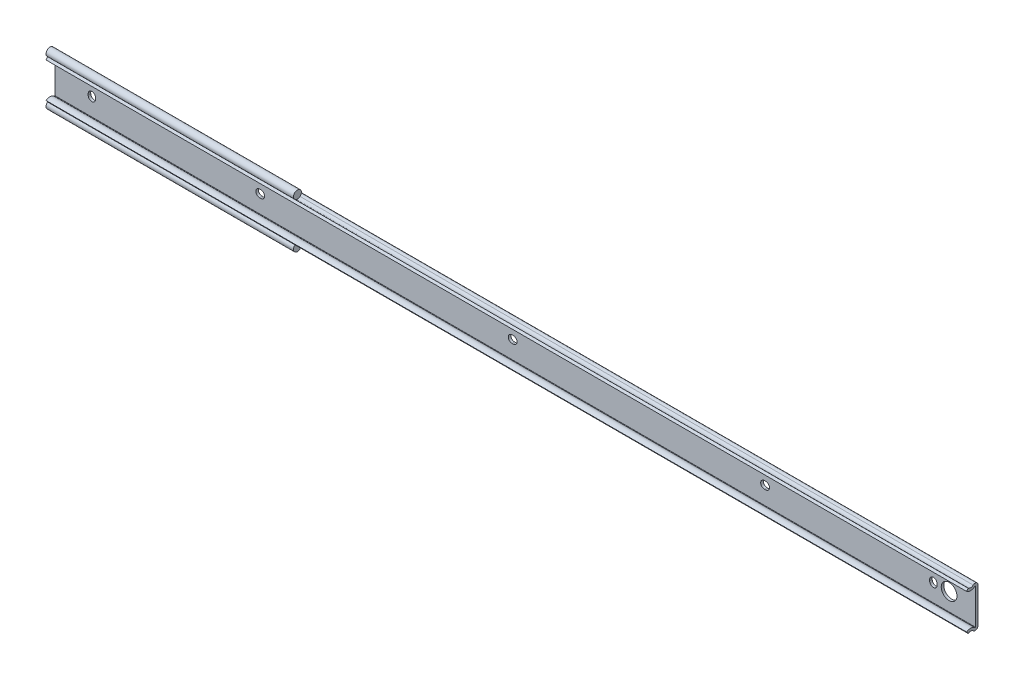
ISO-10303-21;
HEADER;
FILE_DESCRIPTION(('STEP AP214'),'2;1');
FILE_NAME('part.step','',(''),(''),'','','');
FILE_SCHEMA(('AUTOMOTIVE_DESIGN { 1 0 10303 214 1 1 1 1 }'));
ENDSEC;
DATA;
#1=APPLICATION_CONTEXT('core data for automotive mechanical design processes');
#2=APPLICATION_PROTOCOL_DEFINITION('international standard','automotive_design',2000,#1);
#3=PRODUCT_CONTEXT('',#1,'mechanical');
#4=PRODUCT('Part','Part','',(#3));
#5=PRODUCT_RELATED_PRODUCT_CATEGORY('part','',(#4));
#6=PRODUCT_DEFINITION_FORMATION('','',#4);
#7=PRODUCT_DEFINITION_CONTEXT('part definition',#1,'design');
#8=PRODUCT_DEFINITION('design','',#6,#7);
#9=PRODUCT_DEFINITION_SHAPE('','',#8);
#10=(LENGTH_UNIT() NAMED_UNIT(*) SI_UNIT(.MILLI.,.METRE.));
#11=(NAMED_UNIT(*) PLANE_ANGLE_UNIT() SI_UNIT($,.RADIAN.));
#12=(NAMED_UNIT(*) SI_UNIT($,.STERADIAN.) SOLID_ANGLE_UNIT());
#13=UNCERTAINTY_MEASURE_WITH_UNIT(LENGTH_MEASURE(1.E-05),#10,'distance_accuracy_value','');
#14=(GEOMETRIC_REPRESENTATION_CONTEXT(3) GLOBAL_UNCERTAINTY_ASSIGNED_CONTEXT((#13)) GLOBAL_UNIT_ASSIGNED_CONTEXT((#10,
#11,#12)) REPRESENTATION_CONTEXT('',''));
#15=CARTESIAN_POINT('',(0.,0.,0.));
#16=DIRECTION('',(0.,0.,1.));
#17=DIRECTION('',(1.,0.,0.));
#18=AXIS2_PLACEMENT_3D('',#15,#16,#17);
#19=CARTESIAN_POINT('',(533.4,10.6847650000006,1.74000019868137));
#20=DIRECTION('',(-1.,0.,0.));
#21=DIRECTION('',(0.,0.,1.));
#22=AXIS2_PLACEMENT_3D('',#19,#20,#21);
#23=CYLINDRICAL_SURFACE('',#22,1.7400001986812);
#24=CARTESIAN_POINT('',(-22.4,10.6847650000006,1.74000019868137));
#25=DIRECTION('',(1.,0.,0.));
#26=DIRECTION('',(0.,0.,-1.));
#27=AXIS2_PLACEMENT_3D('',#24,#25,#26);
#28=CIRCLE('',#27,1.7400001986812);
#29=CARTESIAN_POINT('',(-22.4,12.421670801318,1.84372545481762));
#30=VERTEX_POINT('',#29);
#31=CARTESIAN_POINT('',(-22.4,12.1726708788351,2.64207380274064));
#32=VERTEX_POINT('',#31);
#33=EDGE_CURVE('E275',#30,#32,#28,.T.);
#34=ORIENTED_EDGE('',*,*,#33,.T.);
#35=DIRECTION('',(-1.,0.,0.));
#36=VECTOR('',#35,1.);
#37=CARTESIAN_POINT('',(52.3,12.1726708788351,2.64207380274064));
#38=LINE('',#37,#36);
#39=CARTESIAN_POINT('',(127.,12.1726708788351,2.64207380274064));
#40=VERTEX_POINT('',#39);
#41=EDGE_CURVE('E492',#32,#40,#38,.F.);
#42=ORIENTED_EDGE('',*,*,#41,.T.);
#43=CARTESIAN_POINT('',(127.,10.6847650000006,1.74000019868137));
#44=DIRECTION('',(-1.,0.,0.));
#45=DIRECTION('',(0.,0.,1.));
#46=AXIS2_PLACEMENT_3D('',#43,#44,#45);
#47=CIRCLE('',#46,1.7400001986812);
#48=CARTESIAN_POINT('',(127.,11.9768810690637,2.90534853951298));
#49=VERTEX_POINT('',#48);
#50=EDGE_CURVE('E488',#49,#40,#47,.T.);
#51=ORIENTED_EDGE('',*,*,#50,.F.);
#52=DIRECTION('',(-1.,0.,0.));
#53=VECTOR('',#52,1.);
#54=CARTESIAN_POINT('',(533.4,11.9768810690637,2.90534853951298));
#55=LINE('',#54,#53);
#56=CARTESIAN_POINT('',(533.4,11.9768810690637,2.90534853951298));
#57=VERTEX_POINT('',#56);
#58=EDGE_CURVE('E365',#57,#49,#55,.T.);
#59=ORIENTED_EDGE('',*,*,#58,.F.);
#60=CARTESIAN_POINT('',(533.4,10.6847650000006,1.74000019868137));
#61=DIRECTION('',(1.,0.,0.));
#62=DIRECTION('',(0.,0.,-1.));
#63=AXIS2_PLACEMENT_3D('',#60,#61,#62);
#64=CIRCLE('',#63,1.7400001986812);
#65=CARTESIAN_POINT('',(533.4,12.421670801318,1.84372545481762));
#66=VERTEX_POINT('',#65);
#67=EDGE_CURVE('E272',#66,#57,#64,.T.);
#68=ORIENTED_EDGE('',*,*,#67,.F.);
#69=CARTESIAN_POINT('',(533.4,10.6847650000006,1.74000019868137));
#70=DIRECTION('',(-1.,0.,0.));
#71=DIRECTION('',(0.,0.998221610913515,0.0596122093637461));
#72=AXIS2_PLACEMENT_3D('',#69,#70,#71);
#73=CIRCLE('',#72,1.7400001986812);
#74=CARTESIAN_POINT('',(533.4,12.421670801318,1.63627494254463));
#75=VERTEX_POINT('',#74);
#76=EDGE_CURVE('E263',#66,#75,#73,.T.);
#77=ORIENTED_EDGE('',*,*,#76,.T.);
#78=CARTESIAN_POINT('',(533.4,10.6847650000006,0.));
#79=VERTEX_POINT('',#78);
#80=EDGE_CURVE('E260',#79,#75,#64,.T.);
#81=ORIENTED_EDGE('',*,*,#80,.F.);
#82=DIRECTION('',(-1.,0.,0.));
#83=VECTOR('',#82,1.);
#84=CARTESIAN_POINT('',(533.4,10.6847650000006,0.));
#85=LINE('',#84,#83);
#86=CARTESIAN_POINT('',(-22.4,10.6847650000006,0.));
#87=VERTEX_POINT('',#86);
#88=EDGE_CURVE('E397',#79,#87,#85,.T.);
#89=ORIENTED_EDGE('',*,*,#88,.T.);
#90=CARTESIAN_POINT('',(-22.4,12.421670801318,1.63627494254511));
#91=VERTEX_POINT('',#90);
#92=EDGE_CURVE('E292',#87,#91,#28,.T.);
#93=ORIENTED_EDGE('',*,*,#92,.T.);
#94=CARTESIAN_POINT('',(-22.4,10.6847650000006,1.74000019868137));
#95=DIRECTION('',(1.,0.,0.));
#96=DIRECTION('',(0.,0.998221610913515,-0.0596122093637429));
#97=AXIS2_PLACEMENT_3D('',#94,#95,#96);
#98=CIRCLE('',#97,1.7400001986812);
#99=EDGE_CURVE('E289',#91,#30,#98,.T.);
#100=ORIENTED_EDGE('',*,*,#99,.T.);
#101=EDGE_LOOP('',(#34,#42,#51,#59,#68,#77,#81,#89,#93,#100));
#102=FACE_BOUND('',#101,.T.);
#103=ADVANCED_FACE('F14',(#102),#23,.T.);
#104=CARTESIAN_POINT('',(533.4,10.6847650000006,1.74000019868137));
#105=DIRECTION('',(1.,0.,0.));
#106=DIRECTION('',(0.,0.,-1.));
#107=AXIS2_PLACEMENT_3D('',#104,#105,#106);
#108=PLANE('',#107);
#109=DIRECTION('',(0.,1.,0.));
#110=VECTOR('',#109,1.);
#111=CARTESIAN_POINT('',(533.4,-10.6847650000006,0.));
#112=LINE('',#111,#110);
#113=CARTESIAN_POINT('',(533.4,-10.6847650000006,0.));
#114=VERTEX_POINT('',#113);
#115=EDGE_CURVE('E267',#114,#79,#112,.T.);
#116=ORIENTED_EDGE('',*,*,#115,.T.);
#117=ORIENTED_EDGE('',*,*,#80,.T.);
#118=ORIENTED_EDGE('',*,*,#76,.F.);
#119=ORIENTED_EDGE('',*,*,#67,.T.);
#120=CARTESIAN_POINT('',(533.4,13.7450000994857,4.50000028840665));
#121=DIRECTION('',(-1.,0.,0.));
#122=DIRECTION('',(0.,0.,-1.));
#123=AXIS2_PLACEMENT_3D('',#120,#121,#122);
#124=CIRCLE('',#123,2.38099960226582);
#125=CARTESIAN_POINT('',(533.4,11.8434490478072,5.93292132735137));
#126=VERTEX_POINT('',#125);
#127=EDGE_CURVE('E271',#57,#126,#124,.T.);
#128=ORIENTED_EDGE('',*,*,#127,.T.);
#129=DIRECTION('',(0.,-0.798635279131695,0.601815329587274));
#130=VECTOR('',#129,1.);
#131=CARTESIAN_POINT('',(533.4,10.6055642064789,6.86573520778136));
#132=LINE('',#131,#130);
#133=CARTESIAN_POINT('',(533.4,10.6055642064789,6.86573520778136));
#134=VERTEX_POINT('',#133);
#135=EDGE_CURVE('E415',#126,#134,#132,.T.);
#136=ORIENTED_EDGE('',*,*,#135,.T.);
#137=CARTESIAN_POINT('',(533.4,13.7450000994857,4.50000028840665));
#138=DIRECTION('',(1.,0.,0.));
#139=DIRECTION('',(0.,0.,-1.));
#140=AXIS2_PLACEMENT_3D('',#137,#138,#139);
#141=CIRCLE('',#140,3.9309998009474);
#142=CARTESIAN_POINT('',(533.4,10.8258581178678,1.86725086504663));
#143=VERTEX_POINT('',#142);
#144=EDGE_CURVE('E414',#134,#143,#141,.T.);
#145=ORIENTED_EDGE('',*,*,#144,.T.);
#146=CARTESIAN_POINT('',(533.4,10.6847650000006,1.74000019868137));
#147=DIRECTION('',(-1.,0.,0.));
#148=DIRECTION('',(0.,0.,-1.));
#149=AXIS2_PLACEMENT_3D('',#146,#147,#148);
#150=CIRCLE('',#149,0.18999999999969);
#151=CARTESIAN_POINT('',(533.4,10.6847650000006,1.55000019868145));
#152=VERTEX_POINT('',#151);
#153=EDGE_CURVE('E412',#143,#152,#150,.T.);
#154=ORIENTED_EDGE('',*,*,#153,.T.);
#155=DIRECTION('',(0.,-1.,0.));
#156=VECTOR('',#155,1.);
#157=CARTESIAN_POINT('',(533.4,-10.6847650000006,1.55000019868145));
#158=LINE('',#157,#156);
#159=CARTESIAN_POINT('',(533.4,-10.6847650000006,1.55000019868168));
#160=VERTEX_POINT('',#159);
#161=EDGE_CURVE('E410',#152,#160,#158,.T.);
#162=ORIENTED_EDGE('',*,*,#161,.T.);
#163=CARTESIAN_POINT('',(533.4,-10.6847650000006,1.74000019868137));
#164=DIRECTION('',(-1.,0.,0.));
#165=DIRECTION('',(0.,0.,1.));
#166=AXIS2_PLACEMENT_3D('',#163,#164,#165);
#167=CIRCLE('',#166,0.18999999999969);
#168=CARTESIAN_POINT('',(533.4,-10.8258581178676,1.86725086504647));
#169=VERTEX_POINT('',#168);
#170=EDGE_CURVE('E408',#160,#169,#167,.T.);
#171=ORIENTED_EDGE('',*,*,#170,.T.);
#172=CARTESIAN_POINT('',(533.4,-13.7450000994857,4.50000028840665));
#173=DIRECTION('',(1.,0.,0.));
#174=DIRECTION('',(0.,0.,1.));
#175=AXIS2_PLACEMENT_3D('',#172,#173,#174);
#176=CIRCLE('',#175,3.9309998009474);
#177=CARTESIAN_POINT('',(533.4,-10.6055642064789,6.86573520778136));
#178=VERTEX_POINT('',#177);
#179=EDGE_CURVE('E406',#169,#178,#176,.T.);
#180=ORIENTED_EDGE('',*,*,#179,.T.);
#181=DIRECTION('',(0.,-0.798635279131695,-0.601815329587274));
#182=VECTOR('',#181,1.);
#183=CARTESIAN_POINT('',(533.4,-10.6055642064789,6.86573520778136));
#184=LINE('',#183,#182);
#185=CARTESIAN_POINT('',(533.4,-11.8434490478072,5.93292132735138));
#186=VERTEX_POINT('',#185);
#187=EDGE_CURVE('E404',#178,#186,#184,.T.);
#188=ORIENTED_EDGE('',*,*,#187,.T.);
#189=CARTESIAN_POINT('',(533.4,-13.7450000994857,4.50000028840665));
#190=DIRECTION('',(-1.,0.,0.));
#191=DIRECTION('',(0.,0.,1.));
#192=AXIS2_PLACEMENT_3D('',#189,#190,#191);
#193=CIRCLE('',#192,2.38099960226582);
#194=CARTESIAN_POINT('',(533.4,-11.9768810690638,2.90534853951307));
#195=VERTEX_POINT('',#194);
#196=EDGE_CURVE('E402',#186,#195,#193,.T.);
#197=ORIENTED_EDGE('',*,*,#196,.T.);
#198=CARTESIAN_POINT('',(533.4,-10.6847650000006,1.74000019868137));
#199=DIRECTION('',(1.,0.,0.));
#200=DIRECTION('',(0.,0.,1.));
#201=AXIS2_PLACEMENT_3D('',#198,#199,#200);
#202=CIRCLE('',#201,1.7400001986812);
#203=EDGE_CURVE('E400',#195,#114,#202,.T.);
#204=ORIENTED_EDGE('',*,*,#203,.T.);
#205=EDGE_LOOP('',(#116,#117,#118,#119,#128,#136,#145,#154,#162,#171,#180,#188,#197,#204));
#206=FACE_BOUND('',#205,.T.);
#207=ADVANCED_FACE('F262',(#206),#108,.T.);
#208=CARTESIAN_POINT('',(-22.4,10.6847650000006,1.74000019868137));
#209=DIRECTION('',(1.,0.,0.));
#210=DIRECTION('',(0.,0.,-1.));
#211=AXIS2_PLACEMENT_3D('',#208,#209,#210);
#212=PLANE('',#211);
#213=CARTESIAN_POINT('',(-22.4,13.745,4.45));
#214=DIRECTION('',(-1.,0.,0.));
#215=DIRECTION('',(0.,0.,1.));
#216=AXIS2_PLACEMENT_3D('',#213,#214,#215);
#217=CIRCLE('',#216,2.396);
#218=CARTESIAN_POINT('',(-22.3999999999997,11.4666473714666,5.19156948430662));
#219=VERTEX_POINT('',#218);
#220=EDGE_CURVE('E484',#219,#32,#217,.T.);
#221=ORIENTED_EDGE('',*,*,#220,.T.);
#222=ORIENTED_EDGE('',*,*,#33,.F.);
#223=ORIENTED_EDGE('',*,*,#99,.F.);
#224=ORIENTED_EDGE('',*,*,#92,.F.);
#225=DIRECTION('',(0.,1.,0.));
#226=VECTOR('',#225,1.);
#227=CARTESIAN_POINT('',(-22.4,-10.6847650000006,0.));
#228=LINE('',#227,#226);
#229=CARTESIAN_POINT('',(-22.4,-10.6847650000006,0.));
#230=VERTEX_POINT('',#229);
#231=EDGE_CURVE('E318',#230,#87,#228,.T.);
#232=ORIENTED_EDGE('',*,*,#231,.F.);
#233=CARTESIAN_POINT('',(-22.4,-10.6847650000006,1.74000019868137));
#234=DIRECTION('',(1.,0.,0.));
#235=DIRECTION('',(0.,0.,1.));
#236=AXIS2_PLACEMENT_3D('',#233,#234,#235);
#237=CIRCLE('',#236,1.7400001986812);
#238=CARTESIAN_POINT('',(-22.4,-12.1726708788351,2.64207380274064));
#239=VERTEX_POINT('',#238);
#240=EDGE_CURVE('E316',#239,#230,#237,.T.);
#241=ORIENTED_EDGE('',*,*,#240,.F.);
#242=CARTESIAN_POINT('',(-22.4,-13.745,4.45));
#243=DIRECTION('',(-1.,0.,0.));
#244=DIRECTION('',(0.,0.,-1.));
#245=AXIS2_PLACEMENT_3D('',#242,#243,#244);
#246=CIRCLE('',#245,2.396);
#247=CARTESIAN_POINT('',(-22.4,-11.4666473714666,5.19156948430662));
#248=VERTEX_POINT('',#247);
#249=EDGE_CURVE('E466',#239,#248,#246,.T.);
#250=ORIENTED_EDGE('',*,*,#249,.T.);
#251=CARTESIAN_POINT('',(-22.4,-13.7450000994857,4.50000028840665));
#252=DIRECTION('',(-1.,0.,0.));
#253=DIRECTION('',(0.,0.,1.));
#254=AXIS2_PLACEMENT_3D('',#251,#252,#253);
#255=CIRCLE('',#254,2.38099960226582);
#256=CARTESIAN_POINT('',(-22.4,-11.8434490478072,5.93292132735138));
#257=VERTEX_POINT('',#256);
#258=EDGE_CURVE('E37',#257,#248,#255,.T.);
#259=ORIENTED_EDGE('',*,*,#258,.F.);
#260=DIRECTION('',(0.,-0.798635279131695,-0.601815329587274));
#261=VECTOR('',#260,1.);
#262=CARTESIAN_POINT('',(-22.4,-10.6055642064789,6.86573520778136));
#263=LINE('',#262,#261);
#264=CARTESIAN_POINT('',(-22.4,-10.6055642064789,6.86573520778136));
#265=VERTEX_POINT('',#264);
#266=EDGE_CURVE('E313',#265,#257,#263,.T.);
#267=ORIENTED_EDGE('',*,*,#266,.F.);
#268=CARTESIAN_POINT('',(-22.4,-13.7450000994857,4.50000028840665));
#269=DIRECTION('',(1.,0.,0.));
#270=DIRECTION('',(0.,0.,1.));
#271=AXIS2_PLACEMENT_3D('',#268,#269,#270);
#272=CIRCLE('',#271,3.9309998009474);
#273=CARTESIAN_POINT('',(-22.4,-10.8258581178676,1.86725086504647));
#274=VERTEX_POINT('',#273);
#275=EDGE_CURVE('E311',#274,#265,#272,.T.);
#276=ORIENTED_EDGE('',*,*,#275,.F.);
#277=CARTESIAN_POINT('',(-22.4,-10.6847650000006,1.74000019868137));
#278=DIRECTION('',(-1.,0.,0.));
#279=DIRECTION('',(0.,0.,1.));
#280=AXIS2_PLACEMENT_3D('',#277,#278,#279);
#281=CIRCLE('',#280,0.18999999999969);
#282=CARTESIAN_POINT('',(-22.4,-10.6847650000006,1.55000019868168));
#283=VERTEX_POINT('',#282);
#284=EDGE_CURVE('E309',#283,#274,#281,.T.);
#285=ORIENTED_EDGE('',*,*,#284,.F.);
#286=DIRECTION('',(0.,-1.,0.));
#287=VECTOR('',#286,1.);
#288=CARTESIAN_POINT('',(-22.4,-10.6847650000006,1.55000019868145));
#289=LINE('',#288,#287);
#290=CARTESIAN_POINT('',(-22.4,10.6847650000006,1.55000019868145));
#291=VERTEX_POINT('',#290);
#292=EDGE_CURVE('E307',#291,#283,#289,.T.);
#293=ORIENTED_EDGE('',*,*,#292,.F.);
#294=CARTESIAN_POINT('',(-22.4,10.6847650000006,1.74000019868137));
#295=DIRECTION('',(-1.,0.,0.));
#296=DIRECTION('',(0.,0.,-1.));
#297=AXIS2_PLACEMENT_3D('',#294,#295,#296);
#298=CIRCLE('',#297,0.18999999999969);
#299=CARTESIAN_POINT('',(-22.4,10.8258581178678,1.86725086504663));
#300=VERTEX_POINT('',#299);
#301=EDGE_CURVE('E305',#300,#291,#298,.T.);
#302=ORIENTED_EDGE('',*,*,#301,.F.);
#303=CARTESIAN_POINT('',(-22.4,13.7450000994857,4.50000028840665));
#304=DIRECTION('',(1.,0.,0.));
#305=DIRECTION('',(0.,0.,-1.));
#306=AXIS2_PLACEMENT_3D('',#303,#304,#305);
#307=CIRCLE('',#306,3.9309998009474);
#308=CARTESIAN_POINT('',(-22.4,10.6055642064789,6.86573520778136));
#309=VERTEX_POINT('',#308);
#310=EDGE_CURVE('E303',#309,#300,#307,.T.);
#311=ORIENTED_EDGE('',*,*,#310,.F.);
#312=DIRECTION('',(0.,-0.798635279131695,0.601815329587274));
#313=VECTOR('',#312,1.);
#314=CARTESIAN_POINT('',(-22.4,10.6055642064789,6.86573520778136));
#315=LINE('',#314,#313);
#316=CARTESIAN_POINT('',(-22.4,11.8434490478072,5.93292132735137));
#317=VERTEX_POINT('',#316);
#318=EDGE_CURVE('E301',#317,#309,#315,.T.);
#319=ORIENTED_EDGE('',*,*,#318,.F.);
#320=CARTESIAN_POINT('',(-22.4,13.7450000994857,4.50000028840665));
#321=DIRECTION('',(-1.,0.,0.));
#322=DIRECTION('',(0.,0.,-1.));
#323=AXIS2_PLACEMENT_3D('',#320,#321,#322);
#324=CIRCLE('',#323,2.38099960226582);
#325=EDGE_CURVE('E298',#219,#317,#324,.T.);
#326=ORIENTED_EDGE('',*,*,#325,.F.);
#327=EDGE_LOOP('',(#221,#222,#223,#224,#232,#241,#250,#259,#267,#276,#285,#293,#302,#311,#319,#326));
#328=FACE_BOUND('',#327,.T.);
#329=ADVANCED_FACE('F332',(#328),#212,.F.);
#330=CARTESIAN_POINT('',(533.4,13.7450000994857,4.50000028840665));
#331=DIRECTION('',(-1.,0.,0.));
#332=DIRECTION('',(0.,0.,1.));
#333=AXIS2_PLACEMENT_3D('',#330,#331,#332);
#334=CYLINDRICAL_SURFACE('',#333,2.38099960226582);
#335=CARTESIAN_POINT('',(127.,13.7450000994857,4.50000028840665));
#336=DIRECTION('',(-1.,0.,0.));
#337=DIRECTION('',(0.,0.,1.));
#338=AXIS2_PLACEMENT_3D('',#335,#336,#337);
#339=CIRCLE('',#338,2.38099960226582);
#340=CARTESIAN_POINT('',(127.,11.4666473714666,5.19156948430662));
#341=VERTEX_POINT('',#340);
#342=EDGE_CURVE('E362',#341,#49,#339,.F.);
#343=ORIENTED_EDGE('',*,*,#342,.F.);
#344=DIRECTION('',(-1.,0.,0.));
#345=VECTOR('',#344,1.);
#346=CARTESIAN_POINT('',(52.3,11.4666473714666,5.19156948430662));
#347=LINE('',#346,#345);
#348=EDGE_CURVE('E359',#341,#219,#347,.T.);
#349=ORIENTED_EDGE('',*,*,#348,.T.);
#350=ORIENTED_EDGE('',*,*,#325,.T.);
#351=DIRECTION('',(-1.,0.,0.));
#352=VECTOR('',#351,1.);
#353=CARTESIAN_POINT('',(533.4,11.8434490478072,5.93292132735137));
#354=LINE('',#353,#352);
#355=EDGE_CURVE('E368',#126,#317,#354,.T.);
#356=ORIENTED_EDGE('',*,*,#355,.F.);
#357=ORIENTED_EDGE('',*,*,#127,.F.);
#358=ORIENTED_EDGE('',*,*,#58,.T.);
#359=EDGE_LOOP('',(#343,#349,#350,#356,#357,#358));
#360=FACE_BOUND('',#359,.T.);
#361=ADVANCED_FACE('F342',(#360),#334,.F.);
#362=CARTESIAN_POINT('',(533.4,10.6055642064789,6.86573520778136));
#363=DIRECTION('',(0.,-0.601815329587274,-0.798635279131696));
#364=DIRECTION('',(0.,0.798635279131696,-0.601815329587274));
#365=AXIS2_PLACEMENT_3D('',#362,#363,#364);
#366=PLANE('',#365);
#367=ORIENTED_EDGE('',*,*,#318,.T.);
#368=DIRECTION('',(-1.,0.,0.));
#369=VECTOR('',#368,1.);
#370=CARTESIAN_POINT('',(533.4,10.6055642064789,6.86573520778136));
#371=LINE('',#370,#369);
#372=EDGE_CURVE('E371',#134,#309,#371,.T.);
#373=ORIENTED_EDGE('',*,*,#372,.F.);
#374=ORIENTED_EDGE('',*,*,#135,.F.);
#375=ORIENTED_EDGE('',*,*,#355,.T.);
#376=EDGE_LOOP('',(#367,#373,#374,#375));
#377=FACE_BOUND('',#376,.T.);
#378=ADVANCED_FACE('F423',(#377),#366,.F.);
#379=CARTESIAN_POINT('',(533.4,13.7450000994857,4.50000028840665));
#380=DIRECTION('',(-1.,0.,0.));
#381=DIRECTION('',(0.,0.,1.));
#382=AXIS2_PLACEMENT_3D('',#379,#380,#381);
#383=CYLINDRICAL_SURFACE('',#382,3.9309998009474);
#384=ORIENTED_EDGE('',*,*,#310,.T.);
#385=DIRECTION('',(-1.,0.,0.));
#386=VECTOR('',#385,1.);
#387=CARTESIAN_POINT('',(533.4,10.8258581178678,1.86725086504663));
#388=LINE('',#387,#386);
#389=EDGE_CURVE('E374',#143,#300,#388,.T.);
#390=ORIENTED_EDGE('',*,*,#389,.F.);
#391=ORIENTED_EDGE('',*,*,#144,.F.);
#392=ORIENTED_EDGE('',*,*,#372,.T.);
#393=EDGE_LOOP('',(#384,#390,#391,#392));
#394=FACE_BOUND('',#393,.T.);
#395=ADVANCED_FACE('F428',(#394),#383,.T.);
#396=CARTESIAN_POINT('',(533.4,10.6847650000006,1.74000019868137));
#397=DIRECTION('',(-1.,0.,0.));
#398=DIRECTION('',(0.,0.,1.));
#399=AXIS2_PLACEMENT_3D('',#396,#397,#398);
#400=CYLINDRICAL_SURFACE('',#399,0.18999999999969);
#401=ORIENTED_EDGE('',*,*,#301,.T.);
#402=DIRECTION('',(-1.,0.,0.));
#403=VECTOR('',#402,1.);
#404=CARTESIAN_POINT('',(533.4,10.6847650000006,1.55000019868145));
#405=LINE('',#404,#403);
#406=EDGE_CURVE('E377',#152,#291,#405,.T.);
#407=ORIENTED_EDGE('',*,*,#406,.F.);
#408=ORIENTED_EDGE('',*,*,#153,.F.);
#409=ORIENTED_EDGE('',*,*,#389,.T.);
#410=EDGE_LOOP('',(#401,#407,#408,#409));
#411=FACE_BOUND('',#410,.T.);
#412=ADVANCED_FACE('F434',(#411),#400,.F.);
#413=CARTESIAN_POINT('',(533.4,-10.6847650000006,1.55000019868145));
#414=DIRECTION('',(0.,0.,-1.));
#415=DIRECTION('',(-1.,0.,0.));
#416=AXIS2_PLACEMENT_3D('',#413,#414,#415);
#417=PLANE('',#416);
#418=CARTESIAN_POINT('',(517.5,0.,1.55000019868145));
#419=DIRECTION('',(0.,0.,-1.));
#420=DIRECTION('',(-1.,0.,0.));
#421=AXIS2_PLACEMENT_3D('',#418,#419,#420);
#422=CIRCLE('',#421,4.75);
#423=CARTESIAN_POINT('',(512.75,0.,1.55000019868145));
#424=VERTEX_POINT('',#423);
#425=EDGE_CURVE('E474',#424,#424,#422,.T.);
#426=ORIENTED_EDGE('',*,*,#425,.T.);
#427=EDGE_LOOP('',(#426));
#428=FACE_BOUND('',#427,.T.);
#429=DIRECTION('',(-1.,0.,0.));
#430=VECTOR('',#429,1.);
#431=CARTESIAN_POINT('',(102.000000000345,2.24999999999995,1.55000019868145));
#432=LINE('',#431,#430);
#433=CARTESIAN_POINT('',(102.000000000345,2.24999999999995,1.55000019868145));
#434=VERTEX_POINT('',#433);
#435=CARTESIAN_POINT('',(101.200000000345,2.24999999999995,1.55000019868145));
#436=VERTEX_POINT('',#435);
#437=EDGE_CURVE('E496',#434,#436,#432,.T.);
#438=ORIENTED_EDGE('',*,*,#437,.F.);
#439=CARTESIAN_POINT('',(102.000000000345,0.,1.55000019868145));
#440=DIRECTION('',(0.,0.,-1.));
#441=DIRECTION('',(-1.,0.,0.));
#442=AXIS2_PLACEMENT_3D('',#439,#440,#441);
#443=CIRCLE('',#442,2.24999999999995);
#444=CARTESIAN_POINT('',(102.000000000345,-2.24999999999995,1.55000019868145));
#445=VERTEX_POINT('',#444);
#446=EDGE_CURVE('E499',#445,#434,#443,.F.);
#447=ORIENTED_EDGE('',*,*,#446,.F.);
#448=DIRECTION('',(1.,0.,0.));
#449=VECTOR('',#448,1.);
#450=CARTESIAN_POINT('',(101.200000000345,-2.24999999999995,1.55000019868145));
#451=LINE('',#450,#449);
#452=CARTESIAN_POINT('',(101.200000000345,-2.24999999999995,1.55000019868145));
#453=VERTEX_POINT('',#452);
#454=EDGE_CURVE('E516',#453,#445,#451,.T.);
#455=ORIENTED_EDGE('',*,*,#454,.F.);
#456=CARTESIAN_POINT('',(101.200000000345,0.,1.55000019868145));
#457=DIRECTION('',(0.,0.,-1.));
#458=DIRECTION('',(-1.,0.,0.));
#459=AXIS2_PLACEMENT_3D('',#456,#457,#458);
#460=CIRCLE('',#459,2.24999999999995);
#461=EDGE_CURVE('E494',#436,#453,#460,.F.);
#462=ORIENTED_EDGE('',*,*,#461,.F.);
#463=EDGE_LOOP('',(#438,#447,#455,#462));
#464=FACE_BOUND('',#463,.T.);
#465=DIRECTION('',(-1.,0.,0.));
#466=VECTOR('',#465,1.);
#467=CARTESIAN_POINT('',(254.4,2.24999999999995,1.55000019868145));
#468=LINE('',#467,#466);
#469=CARTESIAN_POINT('',(254.4,2.24999999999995,1.55000019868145));
#470=VERTEX_POINT('',#469);
#471=CARTESIAN_POINT('',(253.6,2.24999999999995,1.55000019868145));
#472=VERTEX_POINT('',#471);
#473=EDGE_CURVE('E527',#470,#472,#468,.T.);
#474=ORIENTED_EDGE('',*,*,#473,.F.);
#475=CARTESIAN_POINT('',(254.4,0.,1.55000019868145));
#476=DIRECTION('',(0.,0.,-1.));
#477=DIRECTION('',(-1.,0.,0.));
#478=AXIS2_PLACEMENT_3D('',#475,#476,#477);
#479=CIRCLE('',#478,2.24999999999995);
#480=CARTESIAN_POINT('',(254.4,-2.24999999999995,1.55000019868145));
#481=VERTEX_POINT('',#480);
#482=EDGE_CURVE('E530',#481,#470,#479,.F.);
#483=ORIENTED_EDGE('',*,*,#482,.F.);
#484=DIRECTION('',(1.,0.,0.));
#485=VECTOR('',#484,1.);
#486=CARTESIAN_POINT('',(253.6,-2.24999999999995,1.55000019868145));
#487=LINE('',#486,#485);
#488=CARTESIAN_POINT('',(253.6,-2.24999999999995,1.55000019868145));
#489=VERTEX_POINT('',#488);
#490=EDGE_CURVE('E547',#489,#481,#487,.T.);
#491=ORIENTED_EDGE('',*,*,#490,.F.);
#492=CARTESIAN_POINT('',(253.6,0.,1.55000019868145));
#493=DIRECTION('',(0.,0.,-1.));
#494=DIRECTION('',(-1.,0.,0.));
#495=AXIS2_PLACEMENT_3D('',#492,#493,#494);
#496=CIRCLE('',#495,2.24999999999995);
#497=EDGE_CURVE('E525',#472,#489,#496,.F.);
#498=ORIENTED_EDGE('',*,*,#497,.F.);
#499=EDGE_LOOP('',(#474,#483,#491,#498));
#500=FACE_BOUND('',#499,.T.);
#501=DIRECTION('',(0.,-1.,0.));
#502=VECTOR('',#501,1.);
#503=CARTESIAN_POINT('',(-2.25,-0.4,1.55000019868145));
#504=LINE('',#503,#502);
#505=CARTESIAN_POINT('',(-2.25,0.4,1.55000019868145));
#506=VERTEX_POINT('',#505);
#507=CARTESIAN_POINT('',(-2.25,-0.4,1.55000019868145));
#508=VERTEX_POINT('',#507);
#509=EDGE_CURVE('E558',#506,#508,#504,.T.);
#510=ORIENTED_EDGE('',*,*,#509,.F.);
#511=CARTESIAN_POINT('',(0.,0.4,1.55000019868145));
#512=DIRECTION('',(0.,0.,-1.));
#513=DIRECTION('',(-1.,0.,0.));
#514=AXIS2_PLACEMENT_3D('',#511,#512,#513);
#515=CIRCLE('',#514,2.24999999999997);
#516=CARTESIAN_POINT('',(2.25,0.4,1.55000019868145));
#517=VERTEX_POINT('',#516);
#518=EDGE_CURVE('E561',#517,#506,#515,.F.);
#519=ORIENTED_EDGE('',*,*,#518,.F.);
#520=DIRECTION('',(0.,1.,0.));
#521=VECTOR('',#520,1.);
#522=CARTESIAN_POINT('',(2.25,0.4,1.55000019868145));
#523=LINE('',#522,#521);
#524=CARTESIAN_POINT('',(2.25,-0.4,1.55000019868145));
#525=VERTEX_POINT('',#524);
#526=EDGE_CURVE('E578',#525,#517,#523,.T.);
#527=ORIENTED_EDGE('',*,*,#526,.F.);
#528=CARTESIAN_POINT('',(0.,-0.4,1.55000019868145));
#529=DIRECTION('',(0.,0.,-1.));
#530=DIRECTION('',(-1.,0.,0.));
#531=AXIS2_PLACEMENT_3D('',#528,#529,#530);
#532=CIRCLE('',#531,2.24999999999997);
#533=EDGE_CURVE('E556',#508,#525,#532,.F.);
#534=ORIENTED_EDGE('',*,*,#533,.F.);
#535=EDGE_LOOP('',(#510,#519,#527,#534));
#536=FACE_BOUND('',#535,.T.);
#537=DIRECTION('',(0.,-1.,0.));
#538=VECTOR('',#537,1.);
#539=CARTESIAN_POINT('',(505.75,-0.4,1.55000019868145));
#540=LINE('',#539,#538);
#541=CARTESIAN_POINT('',(505.75,0.4,1.55000019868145));
#542=VERTEX_POINT('',#541);
#543=CARTESIAN_POINT('',(505.75,-0.4,1.55000019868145));
#544=VERTEX_POINT('',#543);
#545=EDGE_CURVE('E589',#542,#544,#540,.T.);
#546=ORIENTED_EDGE('',*,*,#545,.F.);
#547=CARTESIAN_POINT('',(508.,0.4,1.55000019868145));
#548=DIRECTION('',(0.,0.,-1.));
#549=DIRECTION('',(-1.,0.,0.));
#550=AXIS2_PLACEMENT_3D('',#547,#548,#549);
#551=CIRCLE('',#550,2.24999999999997);
#552=CARTESIAN_POINT('',(510.25,0.4,1.55000019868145));
#553=VERTEX_POINT('',#552);
#554=EDGE_CURVE('E592',#553,#542,#551,.F.);
#555=ORIENTED_EDGE('',*,*,#554,.F.);
#556=DIRECTION('',(0.,1.,0.));
#557=VECTOR('',#556,1.);
#558=CARTESIAN_POINT('',(510.25,0.4,1.55000019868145));
#559=LINE('',#558,#557);
#560=CARTESIAN_POINT('',(510.25,-0.4,1.55000019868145));
#561=VERTEX_POINT('',#560);
#562=EDGE_CURVE('E609',#561,#553,#559,.T.);
#563=ORIENTED_EDGE('',*,*,#562,.F.);
#564=CARTESIAN_POINT('',(508.,-0.4,1.55000019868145));
#565=DIRECTION('',(0.,0.,-1.));
#566=DIRECTION('',(-1.,0.,0.));
#567=AXIS2_PLACEMENT_3D('',#564,#565,#566);
#568=CIRCLE('',#567,2.24999999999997);
#569=EDGE_CURVE('E587',#544,#561,#568,.F.);
#570=ORIENTED_EDGE('',*,*,#569,.F.);
#571=EDGE_LOOP('',(#546,#555,#563,#570));
#572=FACE_BOUND('',#571,.T.);
#573=DIRECTION('',(-1.,0.,0.));
#574=VECTOR('',#573,1.);
#575=CARTESIAN_POINT('',(406.800000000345,2.24999999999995,1.55000019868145));
#576=LINE('',#575,#574);
#577=CARTESIAN_POINT('',(406.800000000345,2.24999999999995,1.55000019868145));
#578=VERTEX_POINT('',#577);
#579=CARTESIAN_POINT('',(406.000000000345,2.24999999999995,1.55000019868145));
#580=VERTEX_POINT('',#579);
#581=EDGE_CURVE('E620',#578,#580,#576,.T.);
#582=ORIENTED_EDGE('',*,*,#581,.F.);
#583=CARTESIAN_POINT('',(406.800000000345,0.,1.55000019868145));
#584=DIRECTION('',(0.,0.,-1.));
#585=DIRECTION('',(-1.,0.,0.));
#586=AXIS2_PLACEMENT_3D('',#583,#584,#585);
#587=CIRCLE('',#586,2.24999999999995);
#588=CARTESIAN_POINT('',(406.800000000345,-2.24999999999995,1.55000019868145));
#589=VERTEX_POINT('',#588);
#590=EDGE_CURVE('E623',#589,#578,#587,.F.);
#591=ORIENTED_EDGE('',*,*,#590,.F.);
#592=DIRECTION('',(1.,0.,0.));
#593=VECTOR('',#592,1.);
#594=CARTESIAN_POINT('',(406.000000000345,-2.24999999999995,1.55000019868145));
#595=LINE('',#594,#593);
#596=CARTESIAN_POINT('',(406.000000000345,-2.24999999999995,1.55000019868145));
#597=VERTEX_POINT('',#596);
#598=EDGE_CURVE('E276',#597,#589,#595,.T.);
#599=ORIENTED_EDGE('',*,*,#598,.F.);
#600=CARTESIAN_POINT('',(406.000000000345,0.,1.55000019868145));
#601=DIRECTION('',(0.,0.,-1.));
#602=DIRECTION('',(-1.,0.,0.));
#603=AXIS2_PLACEMENT_3D('',#600,#601,#602);
#604=CIRCLE('',#603,2.24999999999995);
#605=EDGE_CURVE('E618',#580,#597,#604,.F.);
#606=ORIENTED_EDGE('',*,*,#605,.F.);
#607=EDGE_LOOP('',(#582,#591,#599,#606));
#608=FACE_BOUND('',#607,.T.);
#609=ORIENTED_EDGE('',*,*,#292,.T.);
#610=DIRECTION('',(-1.,0.,0.));
#611=VECTOR('',#610,1.);
#612=CARTESIAN_POINT('',(533.4,-10.6847650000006,1.55000019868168));
#613=LINE('',#612,#611);
#614=EDGE_CURVE('E380',#160,#283,#613,.T.);
#615=ORIENTED_EDGE('',*,*,#614,.F.);
#616=ORIENTED_EDGE('',*,*,#161,.F.);
#617=ORIENTED_EDGE('',*,*,#406,.T.);
#618=EDGE_LOOP('',(#609,#615,#616,#617));
#619=FACE_BOUND('',#618,.T.);
#620=ADVANCED_FACE('F438',(#428,#464,#500,#536,#572,#608,#619),#417,.F.);
#621=CARTESIAN_POINT('',(533.4,-10.6847650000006,1.74000019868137));
#622=DIRECTION('',(-1.,0.,0.));
#623=DIRECTION('',(0.,0.,1.));
#624=AXIS2_PLACEMENT_3D('',#621,#622,#623);
#625=CYLINDRICAL_SURFACE('',#624,0.18999999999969);
#626=ORIENTED_EDGE('',*,*,#284,.T.);
#627=DIRECTION('',(-1.,0.,0.));
#628=VECTOR('',#627,1.);
#629=CARTESIAN_POINT('',(533.4,-10.8258581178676,1.86725086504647));
#630=LINE('',#629,#628);
#631=EDGE_CURVE('E383',#169,#274,#630,.T.);
#632=ORIENTED_EDGE('',*,*,#631,.F.);
#633=ORIENTED_EDGE('',*,*,#170,.F.);
#634=ORIENTED_EDGE('',*,*,#614,.T.);
#635=EDGE_LOOP('',(#626,#632,#633,#634));
#636=FACE_BOUND('',#635,.T.);
#637=ADVANCED_FACE('F443',(#636),#625,.F.);
#638=CARTESIAN_POINT('',(533.4,-13.7450000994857,4.50000028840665));
#639=DIRECTION('',(-1.,0.,0.));
#640=DIRECTION('',(0.,0.,1.));
#641=AXIS2_PLACEMENT_3D('',#638,#639,#640);
#642=CYLINDRICAL_SURFACE('',#641,3.9309998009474);
#643=ORIENTED_EDGE('',*,*,#275,.T.);
#644=DIRECTION('',(-1.,0.,0.));
#645=VECTOR('',#644,1.);
#646=CARTESIAN_POINT('',(533.4,-10.6055642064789,6.86573520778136));
#647=LINE('',#646,#645);
#648=EDGE_CURVE('E386',#178,#265,#647,.T.);
#649=ORIENTED_EDGE('',*,*,#648,.F.);
#650=ORIENTED_EDGE('',*,*,#179,.F.);
#651=ORIENTED_EDGE('',*,*,#631,.T.);
#652=EDGE_LOOP('',(#643,#649,#650,#651));
#653=FACE_BOUND('',#652,.T.);
#654=ADVANCED_FACE('F449',(#653),#642,.T.);
#655=CARTESIAN_POINT('',(533.4,-10.6055642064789,6.86573520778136));
#656=DIRECTION('',(0.,0.601815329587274,-0.798635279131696));
#657=DIRECTION('',(0.,0.798635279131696,0.601815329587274));
#658=AXIS2_PLACEMENT_3D('',#655,#656,#657);
#659=PLANE('',#658);
#660=ORIENTED_EDGE('',*,*,#266,.T.);
#661=DIRECTION('',(-1.,0.,0.));
#662=VECTOR('',#661,1.);
#663=CARTESIAN_POINT('',(533.4,-11.8434490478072,5.93292132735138));
#664=LINE('',#663,#662);
#665=EDGE_CURVE('E389',#186,#257,#664,.T.);
#666=ORIENTED_EDGE('',*,*,#665,.F.);
#667=ORIENTED_EDGE('',*,*,#187,.F.);
#668=ORIENTED_EDGE('',*,*,#648,.T.);
#669=EDGE_LOOP('',(#660,#666,#667,#668));
#670=FACE_BOUND('',#669,.T.);
#671=ADVANCED_FACE('F453',(#670),#659,.F.);
#672=CARTESIAN_POINT('',(533.4,-13.7450000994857,4.50000028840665));
#673=DIRECTION('',(-1.,0.,0.));
#674=DIRECTION('',(0.,0.,1.));
#675=AXIS2_PLACEMENT_3D('',#672,#673,#674);
#676=CYLINDRICAL_SURFACE('',#675,2.38099960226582);
#677=ORIENTED_EDGE('',*,*,#258,.T.);
#678=DIRECTION('',(-1.,0.,0.));
#679=VECTOR('',#678,1.);
#680=CARTESIAN_POINT('',(52.3,-11.4666473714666,5.19156948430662));
#681=LINE('',#680,#679);
#682=CARTESIAN_POINT('',(127.,-11.4666473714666,5.19156948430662));
#683=VERTEX_POINT('',#682);
#684=EDGE_CURVE('E32',#248,#683,#681,.F.);
#685=ORIENTED_EDGE('',*,*,#684,.T.);
#686=CARTESIAN_POINT('',(127.,-13.7450000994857,4.50000028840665));
#687=DIRECTION('',(1.,0.,0.));
#688=DIRECTION('',(0.,0.,-1.));
#689=AXIS2_PLACEMENT_3D('',#686,#687,#688);
#690=CIRCLE('',#689,2.38099960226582);
#691=CARTESIAN_POINT('',(127.,-11.9768810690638,2.90534853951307));
#692=VERTEX_POINT('',#691);
#693=EDGE_CURVE('E476',#683,#692,#690,.F.);
#694=ORIENTED_EDGE('',*,*,#693,.T.);
#695=DIRECTION('',(-1.,0.,0.));
#696=VECTOR('',#695,1.);
#697=CARTESIAN_POINT('',(533.4,-11.9768810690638,2.90534853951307));
#698=LINE('',#697,#696);
#699=EDGE_CURVE('E391',#195,#692,#698,.T.);
#700=ORIENTED_EDGE('',*,*,#699,.F.);
#701=ORIENTED_EDGE('',*,*,#196,.F.);
#702=ORIENTED_EDGE('',*,*,#665,.T.);
#703=EDGE_LOOP('',(#677,#685,#694,#700,#701,#702));
#704=FACE_BOUND('',#703,.T.);
#705=ADVANCED_FACE('F456',(#704),#676,.F.);
#706=CARTESIAN_POINT('',(533.4,-10.6847650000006,1.74000019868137));
#707=DIRECTION('',(-1.,0.,0.));
#708=DIRECTION('',(0.,0.,1.));
#709=AXIS2_PLACEMENT_3D('',#706,#707,#708);
#710=CYLINDRICAL_SURFACE('',#709,1.7400001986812);
#711=CARTESIAN_POINT('',(127.,-10.6847650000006,1.74000019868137));
#712=DIRECTION('',(1.,0.,0.));
#713=DIRECTION('',(0.,0.,-1.));
#714=AXIS2_PLACEMENT_3D('',#711,#712,#713);
#715=CIRCLE('',#714,1.7400001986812);
#716=CARTESIAN_POINT('',(127.,-12.1726708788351,2.64207380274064));
#717=VERTEX_POINT('',#716);
#718=EDGE_CURVE('E24',#692,#717,#715,.T.);
#719=ORIENTED_EDGE('',*,*,#718,.T.);
#720=DIRECTION('',(-1.,0.,0.));
#721=VECTOR('',#720,1.);
#722=CARTESIAN_POINT('',(52.3,-12.1726708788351,2.64207380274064));
#723=LINE('',#722,#721);
#724=EDGE_CURVE('E9',#717,#239,#723,.T.);
#725=ORIENTED_EDGE('',*,*,#724,.T.);
#726=ORIENTED_EDGE('',*,*,#240,.T.);
#727=DIRECTION('',(-1.,0.,0.));
#728=VECTOR('',#727,1.);
#729=CARTESIAN_POINT('',(533.4,-10.6847650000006,0.));
#730=LINE('',#729,#728);
#731=EDGE_CURVE('E394',#114,#230,#730,.T.);
#732=ORIENTED_EDGE('',*,*,#731,.F.);
#733=ORIENTED_EDGE('',*,*,#203,.F.);
#734=ORIENTED_EDGE('',*,*,#699,.T.);
#735=EDGE_LOOP('',(#719,#725,#726,#732,#733,#734));
#736=FACE_BOUND('',#735,.T.);
#737=ADVANCED_FACE('F460',(#736),#710,.T.);
#738=CARTESIAN_POINT('',(533.4,-10.6847650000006,0.));
#739=DIRECTION('',(0.,0.,1.));
#740=DIRECTION('',(1.,0.,0.));
#741=AXIS2_PLACEMENT_3D('',#738,#739,#740);
#742=PLANE('',#741);
#743=CARTESIAN_POINT('',(517.5,0.,0.));
#744=DIRECTION('',(0.,0.,-1.));
#745=DIRECTION('',(-1.,0.,0.));
#746=AXIS2_PLACEMENT_3D('',#743,#744,#745);
#747=CIRCLE('',#746,4.75);
#748=CARTESIAN_POINT('',(512.75,0.,0.));
#749=VERTEX_POINT('',#748);
#750=EDGE_CURVE('E479',#749,#749,#747,.T.);
#751=ORIENTED_EDGE('',*,*,#750,.F.);
#752=EDGE_LOOP('',(#751));
#753=FACE_BOUND('',#752,.T.);
#754=DIRECTION('',(-1.,0.,0.));
#755=VECTOR('',#754,1.);
#756=CARTESIAN_POINT('',(101.200000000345,-2.24999999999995,0.));
#757=LINE('',#756,#755);
#758=CARTESIAN_POINT('',(102.000000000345,-2.24999999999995,0.));
#759=VERTEX_POINT('',#758);
#760=CARTESIAN_POINT('',(101.200000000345,-2.24999999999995,0.));
#761=VERTEX_POINT('',#760);
#762=EDGE_CURVE('E504',#759,#761,#757,.T.);
#763=ORIENTED_EDGE('',*,*,#762,.F.);
#764=CARTESIAN_POINT('',(102.000000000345,0.,0.));
#765=DIRECTION('',(0.,0.,-1.));
#766=DIRECTION('',(-1.,0.,0.));
#767=AXIS2_PLACEMENT_3D('',#764,#765,#766);
#768=CIRCLE('',#767,2.24999999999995);
#769=CARTESIAN_POINT('',(102.000000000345,2.24999999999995,0.));
#770=VERTEX_POINT('',#769);
#771=EDGE_CURVE('E502',#770,#759,#768,.T.);
#772=ORIENTED_EDGE('',*,*,#771,.F.);
#773=DIRECTION('',(1.,0.,0.));
#774=VECTOR('',#773,1.);
#775=CARTESIAN_POINT('',(102.000000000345,2.24999999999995,0.));
#776=LINE('',#775,#774);
#777=CARTESIAN_POINT('',(101.200000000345,2.24999999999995,0.));
#778=VERTEX_POINT('',#777);
#779=EDGE_CURVE('E510',#778,#770,#776,.T.);
#780=ORIENTED_EDGE('',*,*,#779,.F.);
#781=CARTESIAN_POINT('',(101.200000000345,0.,0.));
#782=DIRECTION('',(0.,0.,-1.));
#783=DIRECTION('',(-1.,0.,0.));
#784=AXIS2_PLACEMENT_3D('',#781,#782,#783);
#785=CIRCLE('',#784,2.24999999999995);
#786=EDGE_CURVE('E507',#761,#778,#785,.T.);
#787=ORIENTED_EDGE('',*,*,#786,.F.);
#788=EDGE_LOOP('',(#763,#772,#780,#787));
#789=FACE_BOUND('',#788,.T.);
#790=DIRECTION('',(-1.,0.,0.));
#791=VECTOR('',#790,1.);
#792=CARTESIAN_POINT('',(253.6,-2.24999999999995,0.));
#793=LINE('',#792,#791);
#794=CARTESIAN_POINT('',(254.4,-2.24999999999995,0.));
#795=VERTEX_POINT('',#794);
#796=CARTESIAN_POINT('',(253.6,-2.24999999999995,0.));
#797=VERTEX_POINT('',#796);
#798=EDGE_CURVE('E535',#795,#797,#793,.T.);
#799=ORIENTED_EDGE('',*,*,#798,.F.);
#800=CARTESIAN_POINT('',(254.4,0.,0.));
#801=DIRECTION('',(0.,0.,-1.));
#802=DIRECTION('',(-1.,0.,0.));
#803=AXIS2_PLACEMENT_3D('',#800,#801,#802);
#804=CIRCLE('',#803,2.24999999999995);
#805=CARTESIAN_POINT('',(254.4,2.24999999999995,0.));
#806=VERTEX_POINT('',#805);
#807=EDGE_CURVE('E533',#806,#795,#804,.T.);
#808=ORIENTED_EDGE('',*,*,#807,.F.);
#809=DIRECTION('',(1.,0.,0.));
#810=VECTOR('',#809,1.);
#811=CARTESIAN_POINT('',(254.4,2.24999999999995,0.));
#812=LINE('',#811,#810);
#813=CARTESIAN_POINT('',(253.6,2.24999999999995,0.));
#814=VERTEX_POINT('',#813);
#815=EDGE_CURVE('E541',#814,#806,#812,.T.);
#816=ORIENTED_EDGE('',*,*,#815,.F.);
#817=CARTESIAN_POINT('',(253.6,0.,0.));
#818=DIRECTION('',(0.,0.,-1.));
#819=DIRECTION('',(-1.,0.,0.));
#820=AXIS2_PLACEMENT_3D('',#817,#818,#819);
#821=CIRCLE('',#820,2.24999999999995);
#822=EDGE_CURVE('E538',#797,#814,#821,.T.);
#823=ORIENTED_EDGE('',*,*,#822,.F.);
#824=EDGE_LOOP('',(#799,#808,#816,#823));
#825=FACE_BOUND('',#824,.T.);
#826=DIRECTION('',(0.,-1.,0.));
#827=VECTOR('',#826,1.);
#828=CARTESIAN_POINT('',(2.25,0.4,0.));
#829=LINE('',#828,#827);
#830=CARTESIAN_POINT('',(2.25,0.4,0.));
#831=VERTEX_POINT('',#830);
#832=CARTESIAN_POINT('',(2.25,-0.4,0.));
#833=VERTEX_POINT('',#832);
#834=EDGE_CURVE('E566',#831,#833,#829,.T.);
#835=ORIENTED_EDGE('',*,*,#834,.F.);
#836=CARTESIAN_POINT('',(0.,0.4,0.));
#837=DIRECTION('',(0.,0.,-1.));
#838=DIRECTION('',(-1.,0.,0.));
#839=AXIS2_PLACEMENT_3D('',#836,#837,#838);
#840=CIRCLE('',#839,2.24999999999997);
#841=CARTESIAN_POINT('',(-2.25,0.4,0.));
#842=VERTEX_POINT('',#841);
#843=EDGE_CURVE('E564',#842,#831,#840,.T.);
#844=ORIENTED_EDGE('',*,*,#843,.F.);
#845=DIRECTION('',(0.,1.,0.));
#846=VECTOR('',#845,1.);
#847=CARTESIAN_POINT('',(-2.25,-0.4,0.));
#848=LINE('',#847,#846);
#849=CARTESIAN_POINT('',(-2.25,-0.4,0.));
#850=VERTEX_POINT('',#849);
#851=EDGE_CURVE('E572',#850,#842,#848,.T.);
#852=ORIENTED_EDGE('',*,*,#851,.F.);
#853=CARTESIAN_POINT('',(0.,-0.4,0.));
#854=DIRECTION('',(0.,0.,-1.));
#855=DIRECTION('',(-1.,0.,0.));
#856=AXIS2_PLACEMENT_3D('',#853,#854,#855);
#857=CIRCLE('',#856,2.24999999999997);
#858=EDGE_CURVE('E569',#833,#850,#857,.T.);
#859=ORIENTED_EDGE('',*,*,#858,.F.);
#860=EDGE_LOOP('',(#835,#844,#852,#859));
#861=FACE_BOUND('',#860,.T.);
#862=DIRECTION('',(0.,-1.,0.));
#863=VECTOR('',#862,1.);
#864=CARTESIAN_POINT('',(510.25,0.4,0.));
#865=LINE('',#864,#863);
#866=CARTESIAN_POINT('',(510.25,0.4,0.));
#867=VERTEX_POINT('',#866);
#868=CARTESIAN_POINT('',(510.25,-0.4,0.));
#869=VERTEX_POINT('',#868);
#870=EDGE_CURVE('E597',#867,#869,#865,.T.);
#871=ORIENTED_EDGE('',*,*,#870,.F.);
#872=CARTESIAN_POINT('',(508.,0.4,0.));
#873=DIRECTION('',(0.,0.,-1.));
#874=DIRECTION('',(-1.,0.,0.));
#875=AXIS2_PLACEMENT_3D('',#872,#873,#874);
#876=CIRCLE('',#875,2.24999999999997);
#877=CARTESIAN_POINT('',(505.75,0.4,0.));
#878=VERTEX_POINT('',#877);
#879=EDGE_CURVE('E595',#878,#867,#876,.T.);
#880=ORIENTED_EDGE('',*,*,#879,.F.);
#881=DIRECTION('',(0.,1.,0.));
#882=VECTOR('',#881,1.);
#883=CARTESIAN_POINT('',(505.75,-0.4,0.));
#884=LINE('',#883,#882);
#885=CARTESIAN_POINT('',(505.75,-0.4,0.));
#886=VERTEX_POINT('',#885);
#887=EDGE_CURVE('E603',#886,#878,#884,.T.);
#888=ORIENTED_EDGE('',*,*,#887,.F.);
#889=CARTESIAN_POINT('',(508.,-0.4,0.));
#890=DIRECTION('',(0.,0.,-1.));
#891=DIRECTION('',(-1.,0.,0.));
#892=AXIS2_PLACEMENT_3D('',#889,#890,#891);
#893=CIRCLE('',#892,2.24999999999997);
#894=EDGE_CURVE('E600',#869,#886,#893,.T.);
#895=ORIENTED_EDGE('',*,*,#894,.F.);
#896=EDGE_LOOP('',(#871,#880,#888,#895));
#897=FACE_BOUND('',#896,.T.);
#898=DIRECTION('',(-1.,0.,0.));
#899=VECTOR('',#898,1.);
#900=CARTESIAN_POINT('',(406.000000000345,-2.24999999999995,0.));
#901=LINE('',#900,#899);
#902=CARTESIAN_POINT('',(406.800000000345,-2.24999999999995,0.));
#903=VERTEX_POINT('',#902);
#904=CARTESIAN_POINT('',(406.000000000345,-2.24999999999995,0.));
#905=VERTEX_POINT('',#904);
#906=EDGE_CURVE('E628',#903,#905,#901,.T.);
#907=ORIENTED_EDGE('',*,*,#906,.F.);
#908=CARTESIAN_POINT('',(406.800000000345,0.,0.));
#909=DIRECTION('',(0.,0.,-1.));
#910=DIRECTION('',(-1.,0.,0.));
#911=AXIS2_PLACEMENT_3D('',#908,#909,#910);
#912=CIRCLE('',#911,2.24999999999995);
#913=CARTESIAN_POINT('',(406.800000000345,2.24999999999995,0.));
#914=VERTEX_POINT('',#913);
#915=EDGE_CURVE('E626',#914,#903,#912,.T.);
#916=ORIENTED_EDGE('',*,*,#915,.F.);
#917=DIRECTION('',(1.,0.,0.));
#918=VECTOR('',#917,1.);
#919=CARTESIAN_POINT('',(406.800000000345,2.24999999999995,0.));
#920=LINE('',#919,#918);
#921=CARTESIAN_POINT('',(406.000000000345,2.24999999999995,0.));
#922=VERTEX_POINT('',#921);
#923=EDGE_CURVE('E634',#922,#914,#920,.T.);
#924=ORIENTED_EDGE('',*,*,#923,.F.);
#925=CARTESIAN_POINT('',(406.000000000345,0.,0.));
#926=DIRECTION('',(0.,0.,-1.));
#927=DIRECTION('',(-1.,0.,0.));
#928=AXIS2_PLACEMENT_3D('',#925,#926,#927);
#929=CIRCLE('',#928,2.24999999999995);
#930=EDGE_CURVE('E631',#905,#922,#929,.T.);
#931=ORIENTED_EDGE('',*,*,#930,.F.);
#932=EDGE_LOOP('',(#907,#916,#924,#931));
#933=FACE_BOUND('',#932,.T.);
#934=ORIENTED_EDGE('',*,*,#231,.T.);
#935=ORIENTED_EDGE('',*,*,#88,.F.);
#936=ORIENTED_EDGE('',*,*,#115,.F.);
#937=ORIENTED_EDGE('',*,*,#731,.T.);
#938=EDGE_LOOP('',(#934,#935,#936,#937));
#939=FACE_BOUND('',#938,.T.);
#940=ADVANCED_FACE('F348',(#753,#789,#825,#861,#897,#933,#939),#742,.F.);
#941=CARTESIAN_POINT('',(406.800000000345,0.,6.86673520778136));
#942=DIRECTION('',(0.,0.,-1.));
#943=DIRECTION('',(-1.,0.,0.));
#944=AXIS2_PLACEMENT_3D('',#941,#942,#943);
#945=CYLINDRICAL_SURFACE('',#944,2.24999999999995);
#946=ORIENTED_EDGE('',*,*,#590,.T.);
#947=DIRECTION('',(0.,0.,-1.));
#948=VECTOR('',#947,1.);
#949=CARTESIAN_POINT('',(406.800000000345,2.24999999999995,6.86673520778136));
#950=LINE('',#949,#948);
#951=EDGE_CURVE('E638',#578,#914,#950,.T.);
#952=ORIENTED_EDGE('',*,*,#951,.T.);
#953=ORIENTED_EDGE('',*,*,#915,.T.);
#954=DIRECTION('',(0.,0.,-1.));
#955=VECTOR('',#954,1.);
#956=CARTESIAN_POINT('',(406.800000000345,-2.24999999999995,6.86673520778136));
#957=LINE('',#956,#955);
#958=EDGE_CURVE('E637',#589,#903,#957,.T.);
#959=ORIENTED_EDGE('',*,*,#958,.F.);
#960=EDGE_LOOP('',(#946,#952,#953,#959));
#961=FACE_BOUND('',#960,.T.);
#962=ADVANCED_FACE('F343',(#961),#945,.F.);
#963=CARTESIAN_POINT('',(406.800000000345,2.24999999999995,6.86673520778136));
#964=DIRECTION('',(0.,1.,0.));
#965=DIRECTION('',(1.,0.,0.));
#966=AXIS2_PLACEMENT_3D('',#963,#964,#965);
#967=PLANE('',#966);
#968=ORIENTED_EDGE('',*,*,#581,.T.);
#969=DIRECTION('',(0.,0.,-1.));
#970=VECTOR('',#969,1.);
#971=CARTESIAN_POINT('',(406.000000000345,2.24999999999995,6.86673520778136));
#972=LINE('',#971,#970);
#973=EDGE_CURVE('E640',#580,#922,#972,.T.);
#974=ORIENTED_EDGE('',*,*,#973,.T.);
#975=ORIENTED_EDGE('',*,*,#923,.T.);
#976=ORIENTED_EDGE('',*,*,#951,.F.);
#977=EDGE_LOOP('',(#968,#974,#975,#976));
#978=FACE_BOUND('',#977,.T.);
#979=ADVANCED_FACE('F662',(#978),#967,.F.);
#980=CARTESIAN_POINT('',(406.000000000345,0.,6.86673520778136));
#981=DIRECTION('',(0.,0.,-1.));
#982=DIRECTION('',(-1.,0.,0.));
#983=AXIS2_PLACEMENT_3D('',#980,#981,#982);
#984=CYLINDRICAL_SURFACE('',#983,2.24999999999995);
#985=ORIENTED_EDGE('',*,*,#605,.T.);
#986=DIRECTION('',(0.,0.,-1.));
#987=VECTOR('',#986,1.);
#988=CARTESIAN_POINT('',(406.000000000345,-2.24999999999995,6.86673520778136));
#989=LINE('',#988,#987);
#990=EDGE_CURVE('E642',#597,#905,#989,.T.);
#991=ORIENTED_EDGE('',*,*,#990,.T.);
#992=ORIENTED_EDGE('',*,*,#930,.T.);
#993=ORIENTED_EDGE('',*,*,#973,.F.);
#994=EDGE_LOOP('',(#985,#991,#992,#993));
#995=FACE_BOUND('',#994,.T.);
#996=ADVANCED_FACE('F657',(#995),#984,.F.);
#997=CARTESIAN_POINT('',(406.000000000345,-2.24999999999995,6.86673520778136));
#998=DIRECTION('',(0.,-1.,0.));
#999=DIRECTION('',(-1.,0.,0.));
#1000=AXIS2_PLACEMENT_3D('',#997,#998,#999);
#1001=PLANE('',#1000);
#1002=ORIENTED_EDGE('',*,*,#598,.T.);
#1003=ORIENTED_EDGE('',*,*,#958,.T.);
#1004=ORIENTED_EDGE('',*,*,#906,.T.);
#1005=ORIENTED_EDGE('',*,*,#990,.F.);
#1006=EDGE_LOOP('',(#1002,#1003,#1004,#1005));
#1007=FACE_BOUND('',#1006,.T.);
#1008=ADVANCED_FACE('F647',(#1007),#1001,.F.);
#1009=CARTESIAN_POINT('',(508.,0.4,6.86673520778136));
#1010=DIRECTION('',(0.,0.,-1.));
#1011=DIRECTION('',(-1.,0.,0.));
#1012=AXIS2_PLACEMENT_3D('',#1009,#1010,#1011);
#1013=CYLINDRICAL_SURFACE('',#1012,2.24999999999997);
#1014=ORIENTED_EDGE('',*,*,#554,.T.);
#1015=DIRECTION('',(0.,0.,-1.));
#1016=VECTOR('',#1015,1.);
#1017=CARTESIAN_POINT('',(505.75,0.4,6.86673520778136));
#1018=LINE('',#1017,#1016);
#1019=EDGE_CURVE('E607',#542,#878,#1018,.T.);
#1020=ORIENTED_EDGE('',*,*,#1019,.T.);
#1021=ORIENTED_EDGE('',*,*,#879,.T.);
#1022=DIRECTION('',(0.,0.,-1.));
#1023=VECTOR('',#1022,1.);
#1024=CARTESIAN_POINT('',(510.25,0.4,6.86673520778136));
#1025=LINE('',#1024,#1023);
#1026=EDGE_CURVE('E606',#553,#867,#1025,.T.);
#1027=ORIENTED_EDGE('',*,*,#1026,.F.);
#1028=EDGE_LOOP('',(#1014,#1020,#1021,#1027));
#1029=FACE_BOUND('',#1028,.T.);
#1030=ADVANCED_FACE('F791',(#1029),#1013,.F.);
#1031=CARTESIAN_POINT('',(505.75,-0.4,6.86673520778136));
#1032=DIRECTION('',(-1.,0.,0.));
#1033=DIRECTION('',(0.,0.,1.));
#1034=AXIS2_PLACEMENT_3D('',#1031,#1032,#1033);
#1035=PLANE('',#1034);
#1036=ORIENTED_EDGE('',*,*,#545,.T.);
#1037=DIRECTION('',(0.,0.,-1.));
#1038=VECTOR('',#1037,1.);
#1039=CARTESIAN_POINT('',(505.75,-0.4,6.86673520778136));
#1040=LINE('',#1039,#1038);
#1041=EDGE_CURVE('E610',#544,#886,#1040,.T.);
#1042=ORIENTED_EDGE('',*,*,#1041,.T.);
#1043=ORIENTED_EDGE('',*,*,#887,.T.);
#1044=ORIENTED_EDGE('',*,*,#1019,.F.);
#1045=EDGE_LOOP('',(#1036,#1042,#1043,#1044));
#1046=FACE_BOUND('',#1045,.T.);
#1047=ADVANCED_FACE('F799',(#1046),#1035,.F.);
#1048=CARTESIAN_POINT('',(508.,-0.4,6.86673520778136));
#1049=DIRECTION('',(0.,0.,-1.));
#1050=DIRECTION('',(-1.,0.,0.));
#1051=AXIS2_PLACEMENT_3D('',#1048,#1049,#1050);
#1052=CYLINDRICAL_SURFACE('',#1051,2.24999999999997);
#1053=ORIENTED_EDGE('',*,*,#569,.T.);
#1054=DIRECTION('',(0.,0.,-1.));
#1055=VECTOR('',#1054,1.);
#1056=CARTESIAN_POINT('',(510.25,-0.4,6.86673520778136));
#1057=LINE('',#1056,#1055);
#1058=EDGE_CURVE('E612',#561,#869,#1057,.T.);
#1059=ORIENTED_EDGE('',*,*,#1058,.T.);
#1060=ORIENTED_EDGE('',*,*,#894,.T.);
#1061=ORIENTED_EDGE('',*,*,#1041,.F.);
#1062=EDGE_LOOP('',(#1053,#1059,#1060,#1061));
#1063=FACE_BOUND('',#1062,.T.);
#1064=ADVANCED_FACE('F808',(#1063),#1052,.F.);
#1065=CARTESIAN_POINT('',(510.25,0.4,6.86673520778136));
#1066=DIRECTION('',(1.,0.,0.));
#1067=DIRECTION('',(0.,0.,-1.));
#1068=AXIS2_PLACEMENT_3D('',#1065,#1066,#1067);
#1069=PLANE('',#1068);
#1070=ORIENTED_EDGE('',*,*,#562,.T.);
#1071=ORIENTED_EDGE('',*,*,#1026,.T.);
#1072=ORIENTED_EDGE('',*,*,#870,.T.);
#1073=ORIENTED_EDGE('',*,*,#1058,.F.);
#1074=EDGE_LOOP('',(#1070,#1071,#1072,#1073));
#1075=FACE_BOUND('',#1074,.T.);
#1076=ADVANCED_FACE('F818',(#1075),#1069,.F.);
#1077=CARTESIAN_POINT('',(0.,0.4,6.86673520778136));
#1078=DIRECTION('',(0.,0.,-1.));
#1079=DIRECTION('',(-1.,0.,0.));
#1080=AXIS2_PLACEMENT_3D('',#1077,#1078,#1079);
#1081=CYLINDRICAL_SURFACE('',#1080,2.24999999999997);
#1082=ORIENTED_EDGE('',*,*,#518,.T.);
#1083=DIRECTION('',(0.,0.,-1.));
#1084=VECTOR('',#1083,1.);
#1085=CARTESIAN_POINT('',(-2.25,0.4,6.86673520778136));
#1086=LINE('',#1085,#1084);
#1087=EDGE_CURVE('E576',#506,#842,#1086,.T.);
#1088=ORIENTED_EDGE('',*,*,#1087,.T.);
#1089=ORIENTED_EDGE('',*,*,#843,.T.);
#1090=DIRECTION('',(0.,0.,-1.));
#1091=VECTOR('',#1090,1.);
#1092=CARTESIAN_POINT('',(2.25,0.4,6.86673520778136));
#1093=LINE('',#1092,#1091);
#1094=EDGE_CURVE('E575',#517,#831,#1093,.T.);
#1095=ORIENTED_EDGE('',*,*,#1094,.F.);
#1096=EDGE_LOOP('',(#1082,#1088,#1089,#1095));
#1097=FACE_BOUND('',#1096,.T.);
#1098=ADVANCED_FACE('F828',(#1097),#1081,.F.);
#1099=CARTESIAN_POINT('',(-2.25,-0.4,6.86673520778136));
#1100=DIRECTION('',(-1.,0.,0.));
#1101=DIRECTION('',(0.,0.,1.));
#1102=AXIS2_PLACEMENT_3D('',#1099,#1100,#1101);
#1103=PLANE('',#1102);
#1104=ORIENTED_EDGE('',*,*,#509,.T.);
#1105=DIRECTION('',(0.,0.,-1.));
#1106=VECTOR('',#1105,1.);
#1107=CARTESIAN_POINT('',(-2.25,-0.4,6.86673520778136));
#1108=LINE('',#1107,#1106);
#1109=EDGE_CURVE('E579',#508,#850,#1108,.T.);
#1110=ORIENTED_EDGE('',*,*,#1109,.T.);
#1111=ORIENTED_EDGE('',*,*,#851,.T.);
#1112=ORIENTED_EDGE('',*,*,#1087,.F.);
#1113=EDGE_LOOP('',(#1104,#1110,#1111,#1112));
#1114=FACE_BOUND('',#1113,.T.);
#1115=ADVANCED_FACE('F838',(#1114),#1103,.F.);
#1116=CARTESIAN_POINT('',(0.,-0.4,6.86673520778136));
#1117=DIRECTION('',(0.,0.,-1.));
#1118=DIRECTION('',(-1.,0.,0.));
#1119=AXIS2_PLACEMENT_3D('',#1116,#1117,#1118);
#1120=CYLINDRICAL_SURFACE('',#1119,2.24999999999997);
#1121=ORIENTED_EDGE('',*,*,#533,.T.);
#1122=DIRECTION('',(0.,0.,-1.));
#1123=VECTOR('',#1122,1.);
#1124=CARTESIAN_POINT('',(2.25,-0.4,6.86673520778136));
#1125=LINE('',#1124,#1123);
#1126=EDGE_CURVE('E581',#525,#833,#1125,.T.);
#1127=ORIENTED_EDGE('',*,*,#1126,.T.);
#1128=ORIENTED_EDGE('',*,*,#858,.T.);
#1129=ORIENTED_EDGE('',*,*,#1109,.F.);
#1130=EDGE_LOOP('',(#1121,#1127,#1128,#1129));
#1131=FACE_BOUND('',#1130,.T.);
#1132=ADVANCED_FACE('F848',(#1131),#1120,.F.);
#1133=CARTESIAN_POINT('',(2.25,0.4,6.86673520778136));
#1134=DIRECTION('',(1.,0.,0.));
#1135=DIRECTION('',(0.,0.,-1.));
#1136=AXIS2_PLACEMENT_3D('',#1133,#1134,#1135);
#1137=PLANE('',#1136);
#1138=ORIENTED_EDGE('',*,*,#526,.T.);
#1139=ORIENTED_EDGE('',*,*,#1094,.T.);
#1140=ORIENTED_EDGE('',*,*,#834,.T.);
#1141=ORIENTED_EDGE('',*,*,#1126,.F.);
#1142=EDGE_LOOP('',(#1138,#1139,#1140,#1141));
#1143=FACE_BOUND('',#1142,.T.);
#1144=ADVANCED_FACE('F858',(#1143),#1137,.F.);
#1145=CARTESIAN_POINT('',(254.4,0.,6.86673520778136));
#1146=DIRECTION('',(0.,0.,-1.));
#1147=DIRECTION('',(-1.,0.,0.));
#1148=AXIS2_PLACEMENT_3D('',#1145,#1146,#1147);
#1149=CYLINDRICAL_SURFACE('',#1148,2.24999999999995);
#1150=ORIENTED_EDGE('',*,*,#482,.T.);
#1151=DIRECTION('',(0.,0.,-1.));
#1152=VECTOR('',#1151,1.);
#1153=CARTESIAN_POINT('',(254.4,2.24999999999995,6.86673520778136));
#1154=LINE('',#1153,#1152);
#1155=EDGE_CURVE('E545',#470,#806,#1154,.T.);
#1156=ORIENTED_EDGE('',*,*,#1155,.T.);
#1157=ORIENTED_EDGE('',*,*,#807,.T.);
#1158=DIRECTION('',(0.,0.,-1.));
#1159=VECTOR('',#1158,1.);
#1160=CARTESIAN_POINT('',(254.4,-2.24999999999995,6.86673520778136));
#1161=LINE('',#1160,#1159);
#1162=EDGE_CURVE('E544',#481,#795,#1161,.T.);
#1163=ORIENTED_EDGE('',*,*,#1162,.F.);
#1164=EDGE_LOOP('',(#1150,#1156,#1157,#1163));
#1165=FACE_BOUND('',#1164,.T.);
#1166=ADVANCED_FACE('F868',(#1165),#1149,.F.);
#1167=CARTESIAN_POINT('',(254.4,2.24999999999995,6.86673520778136));
#1168=DIRECTION('',(0.,1.,0.));
#1169=DIRECTION('',(1.,0.,0.));
#1170=AXIS2_PLACEMENT_3D('',#1167,#1168,#1169);
#1171=PLANE('',#1170);
#1172=ORIENTED_EDGE('',*,*,#473,.T.);
#1173=DIRECTION('',(0.,0.,-1.));
#1174=VECTOR('',#1173,1.);
#1175=CARTESIAN_POINT('',(253.6,2.24999999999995,6.86673520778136));
#1176=LINE('',#1175,#1174);
#1177=EDGE_CURVE('E548',#472,#814,#1176,.T.);
#1178=ORIENTED_EDGE('',*,*,#1177,.T.);
#1179=ORIENTED_EDGE('',*,*,#815,.T.);
#1180=ORIENTED_EDGE('',*,*,#1155,.F.);
#1181=EDGE_LOOP('',(#1172,#1178,#1179,#1180));
#1182=FACE_BOUND('',#1181,.T.);
#1183=ADVANCED_FACE('F878',(#1182),#1171,.F.);
#1184=CARTESIAN_POINT('',(253.6,0.,6.86673520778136));
#1185=DIRECTION('',(0.,0.,-1.));
#1186=DIRECTION('',(-1.,0.,0.));
#1187=AXIS2_PLACEMENT_3D('',#1184,#1185,#1186);
#1188=CYLINDRICAL_SURFACE('',#1187,2.24999999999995);
#1189=ORIENTED_EDGE('',*,*,#497,.T.);
#1190=DIRECTION('',(0.,0.,-1.));
#1191=VECTOR('',#1190,1.);
#1192=CARTESIAN_POINT('',(253.6,-2.24999999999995,6.86673520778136));
#1193=LINE('',#1192,#1191);
#1194=EDGE_CURVE('E550',#489,#797,#1193,.T.);
#1195=ORIENTED_EDGE('',*,*,#1194,.T.);
#1196=ORIENTED_EDGE('',*,*,#822,.T.);
#1197=ORIENTED_EDGE('',*,*,#1177,.F.);
#1198=EDGE_LOOP('',(#1189,#1195,#1196,#1197));
#1199=FACE_BOUND('',#1198,.T.);
#1200=ADVANCED_FACE('F888',(#1199),#1188,.F.);
#1201=CARTESIAN_POINT('',(253.6,-2.24999999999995,6.86673520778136));
#1202=DIRECTION('',(0.,-1.,0.));
#1203=DIRECTION('',(-1.,0.,0.));
#1204=AXIS2_PLACEMENT_3D('',#1201,#1202,#1203);
#1205=PLANE('',#1204);
#1206=ORIENTED_EDGE('',*,*,#490,.T.);
#1207=ORIENTED_EDGE('',*,*,#1162,.T.);
#1208=ORIENTED_EDGE('',*,*,#798,.T.);
#1209=ORIENTED_EDGE('',*,*,#1194,.F.);
#1210=EDGE_LOOP('',(#1206,#1207,#1208,#1209));
#1211=FACE_BOUND('',#1210,.T.);
#1212=ADVANCED_FACE('F898',(#1211),#1205,.F.);
#1213=CARTESIAN_POINT('',(102.000000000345,0.,6.86673520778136));
#1214=DIRECTION('',(0.,0.,-1.));
#1215=DIRECTION('',(-1.,0.,0.));
#1216=AXIS2_PLACEMENT_3D('',#1213,#1214,#1215);
#1217=CYLINDRICAL_SURFACE('',#1216,2.24999999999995);
#1218=ORIENTED_EDGE('',*,*,#446,.T.);
#1219=DIRECTION('',(0.,0.,-1.));
#1220=VECTOR('',#1219,1.);
#1221=CARTESIAN_POINT('',(102.000000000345,2.24999999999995,6.86673520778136));
#1222=LINE('',#1221,#1220);
#1223=EDGE_CURVE('E514',#434,#770,#1222,.T.);
#1224=ORIENTED_EDGE('',*,*,#1223,.T.);
#1225=ORIENTED_EDGE('',*,*,#771,.T.);
#1226=DIRECTION('',(0.,0.,-1.));
#1227=VECTOR('',#1226,1.);
#1228=CARTESIAN_POINT('',(102.000000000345,-2.24999999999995,6.86673520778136));
#1229=LINE('',#1228,#1227);
#1230=EDGE_CURVE('E513',#445,#759,#1229,.T.);
#1231=ORIENTED_EDGE('',*,*,#1230,.F.);
#1232=EDGE_LOOP('',(#1218,#1224,#1225,#1231));
#1233=FACE_BOUND('',#1232,.T.);
#1234=ADVANCED_FACE('F908',(#1233),#1217,.F.);
#1235=CARTESIAN_POINT('',(102.000000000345,2.24999999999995,6.86673520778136));
#1236=DIRECTION('',(0.,1.,0.));
#1237=DIRECTION('',(1.,0.,0.));
#1238=AXIS2_PLACEMENT_3D('',#1235,#1236,#1237);
#1239=PLANE('',#1238);
#1240=ORIENTED_EDGE('',*,*,#437,.T.);
#1241=DIRECTION('',(0.,0.,-1.));
#1242=VECTOR('',#1241,1.);
#1243=CARTESIAN_POINT('',(101.200000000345,2.24999999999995,6.86673520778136));
#1244=LINE('',#1243,#1242);
#1245=EDGE_CURVE('E517',#436,#778,#1244,.T.);
#1246=ORIENTED_EDGE('',*,*,#1245,.T.);
#1247=ORIENTED_EDGE('',*,*,#779,.T.);
#1248=ORIENTED_EDGE('',*,*,#1223,.F.);
#1249=EDGE_LOOP('',(#1240,#1246,#1247,#1248));
#1250=FACE_BOUND('',#1249,.T.);
#1251=ADVANCED_FACE('F918',(#1250),#1239,.F.);
#1252=CARTESIAN_POINT('',(101.200000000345,0.,6.86673520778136));
#1253=DIRECTION('',(0.,0.,-1.));
#1254=DIRECTION('',(-1.,0.,0.));
#1255=AXIS2_PLACEMENT_3D('',#1252,#1253,#1254);
#1256=CYLINDRICAL_SURFACE('',#1255,2.24999999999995);
#1257=ORIENTED_EDGE('',*,*,#461,.T.);
#1258=DIRECTION('',(0.,0.,-1.));
#1259=VECTOR('',#1258,1.);
#1260=CARTESIAN_POINT('',(101.200000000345,-2.24999999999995,6.86673520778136));
#1261=LINE('',#1260,#1259);
#1262=EDGE_CURVE('E519',#453,#761,#1261,.T.);
#1263=ORIENTED_EDGE('',*,*,#1262,.T.);
#1264=ORIENTED_EDGE('',*,*,#786,.T.);
#1265=ORIENTED_EDGE('',*,*,#1245,.F.);
#1266=EDGE_LOOP('',(#1257,#1263,#1264,#1265));
#1267=FACE_BOUND('',#1266,.T.);
#1268=ADVANCED_FACE('F928',(#1267),#1256,.F.);
#1269=CARTESIAN_POINT('',(101.200000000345,-2.24999999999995,6.86673520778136));
#1270=DIRECTION('',(0.,-1.,0.));
#1271=DIRECTION('',(-1.,0.,0.));
#1272=AXIS2_PLACEMENT_3D('',#1269,#1270,#1271);
#1273=PLANE('',#1272);
#1274=ORIENTED_EDGE('',*,*,#454,.T.);
#1275=ORIENTED_EDGE('',*,*,#1230,.T.);
#1276=ORIENTED_EDGE('',*,*,#762,.T.);
#1277=ORIENTED_EDGE('',*,*,#1262,.F.);
#1278=EDGE_LOOP('',(#1274,#1275,#1276,#1277));
#1279=FACE_BOUND('',#1278,.T.);
#1280=ADVANCED_FACE('F938',(#1279),#1273,.F.);
#1281=CARTESIAN_POINT('',(127.,13.745,4.45));
#1282=DIRECTION('',(-1.,0.,0.));
#1283=DIRECTION('',(0.,0.,1.));
#1284=AXIS2_PLACEMENT_3D('',#1281,#1282,#1283);
#1285=CYLINDRICAL_SURFACE('',#1284,2.396);
#1286=ORIENTED_EDGE('',*,*,#41,.F.);
#1287=ORIENTED_EDGE('',*,*,#220,.F.);
#1288=ORIENTED_EDGE('',*,*,#348,.F.);
#1289=CARTESIAN_POINT('',(127.,13.745,4.45));
#1290=DIRECTION('',(-1.,0.,0.));
#1291=DIRECTION('',(0.,0.,1.));
#1292=AXIS2_PLACEMENT_3D('',#1289,#1290,#1291);
#1293=CIRCLE('',#1292,2.396);
#1294=EDGE_CURVE('E485',#341,#40,#1293,.T.);
#1295=ORIENTED_EDGE('',*,*,#1294,.T.);
#1296=EDGE_LOOP('',(#1286,#1287,#1288,#1295));
#1297=FACE_BOUND('',#1296,.T.);
#1298=ADVANCED_FACE('F948',(#1297),#1285,.T.);
#1299=CARTESIAN_POINT('',(127.,13.745,4.45));
#1300=DIRECTION('',(-1.,0.,0.));
#1301=DIRECTION('',(0.,0.,1.));
#1302=AXIS2_PLACEMENT_3D('',#1299,#1300,#1301);
#1303=PLANE('',#1302);
#1304=ORIENTED_EDGE('',*,*,#342,.T.);
#1305=ORIENTED_EDGE('',*,*,#50,.T.);
#1306=ORIENTED_EDGE('',*,*,#1294,.F.);
#1307=EDGE_LOOP('',(#1304,#1305,#1306));
#1308=FACE_BOUND('',#1307,.T.);
#1309=ADVANCED_FACE('F958',(#1308),#1303,.F.);
#1310=CARTESIAN_POINT('',(127.,-13.745,4.45));
#1311=DIRECTION('',(-1.,0.,0.));
#1312=DIRECTION('',(0.,0.,1.));
#1313=AXIS2_PLACEMENT_3D('',#1310,#1311,#1312);
#1314=CYLINDRICAL_SURFACE('',#1313,2.396);
#1315=ORIENTED_EDGE('',*,*,#684,.F.);
#1316=ORIENTED_EDGE('',*,*,#249,.F.);
#1317=ORIENTED_EDGE('',*,*,#724,.F.);
#1318=CARTESIAN_POINT('',(127.,-13.745,4.45));
#1319=DIRECTION('',(-1.,0.,0.));
#1320=DIRECTION('',(0.,0.,-1.));
#1321=AXIS2_PLACEMENT_3D('',#1318,#1319,#1320);
#1322=CIRCLE('',#1321,2.396);
#1323=EDGE_CURVE('E473',#717,#683,#1322,.T.);
#1324=ORIENTED_EDGE('',*,*,#1323,.T.);
#1325=EDGE_LOOP('',(#1315,#1316,#1317,#1324));
#1326=FACE_BOUND('',#1325,.T.);
#1327=ADVANCED_FACE('F472',(#1326),#1314,.T.);
#1328=CARTESIAN_POINT('',(127.,-13.745,4.45));
#1329=DIRECTION('',(1.,0.,0.));
#1330=DIRECTION('',(0.,0.,-1.));
#1331=AXIS2_PLACEMENT_3D('',#1328,#1329,#1330);
#1332=PLANE('',#1331);
#1333=ORIENTED_EDGE('',*,*,#693,.F.);
#1334=ORIENTED_EDGE('',*,*,#1323,.F.);
#1335=ORIENTED_EDGE('',*,*,#718,.F.);
#1336=EDGE_LOOP('',(#1333,#1334,#1335));
#1337=FACE_BOUND('',#1336,.T.);
#1338=ADVANCED_FACE('F977',(#1337),#1332,.T.);
#1339=CARTESIAN_POINT('',(517.5,0.,10.));
#1340=DIRECTION('',(0.,0.,-1.));
#1341=DIRECTION('',(-1.,0.,0.));
#1342=AXIS2_PLACEMENT_3D('',#1339,#1340,#1341);
#1343=CYLINDRICAL_SURFACE('',#1342,4.75);
#1344=ORIENTED_EDGE('',*,*,#750,.T.);
#1345=EDGE_LOOP('',(#1344));
#1346=FACE_BOUND('',#1345,.T.);
#1347=ORIENTED_EDGE('',*,*,#425,.F.);
#1348=EDGE_LOOP('',(#1347));
#1349=FACE_BOUND('',#1348,.T.);
#1350=ADVANCED_FACE('F986',(#1346,#1349),#1343,.F.);
#1351=CLOSED_SHELL('',(#103,#207,#329,#361,#378,#395,#412,#620,#637,#654,#671,#705,#737,#940,
#962,#979,#996,#1008,#1030,#1047,#1064,#1076,#1098,#1115,#1132,#1144,#1166,#1183,#1200,#1212,
#1234,#1251,#1268,#1280,#1298,#1309,#1327,#1338,#1350));
#1352=MANIFOLD_SOLID_BREP('B1',#1351);
#1353=ADVANCED_BREP_SHAPE_REPRESENTATION('',(#18,#1352),#14);
#1354=SHAPE_DEFINITION_REPRESENTATION(#9,#1353);
ENDSEC;
END-ISO-10303-21;
